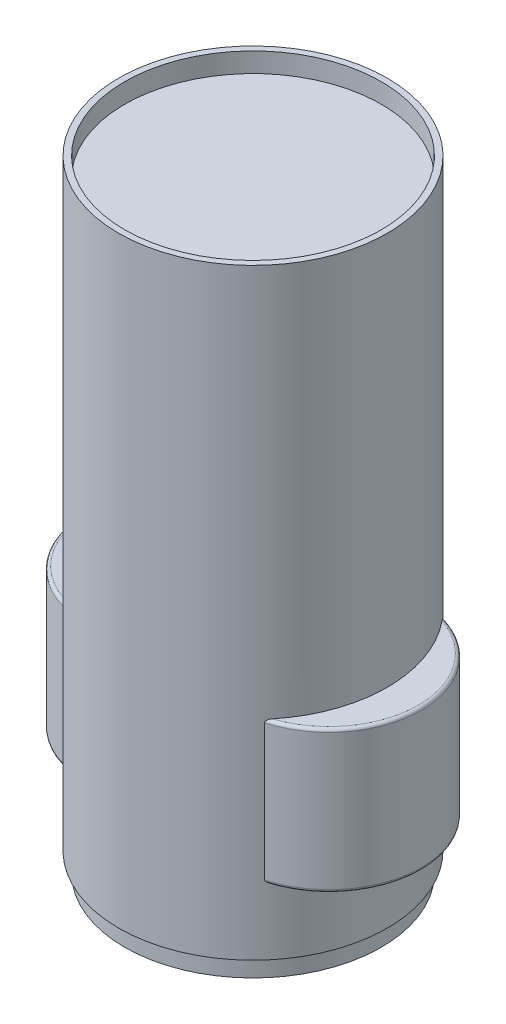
from build123d import *

# Parameters (mm, degrees)
EXTRUDE1_DEPTH = 47.07
EXTRUDE2_START = 100
EXTRUDE2_DEPTH = 100
FILLET1_R      = 1


with BuildPart() as part:
    # Sketch1 → Revolve1 (revolve)
    with BuildSketch(Plane(origin=(0, 0, 0), x_dir=(0, 0, -1), z_dir=(1, 0, 0))):
        Polygon((0, 0), (-42.5, 0), (-42.5, 6.5), (-44.5, 6.5), (-44.5, 205.8), (-42.5, 205.8), (-42.5, 199.3), (0, 199.3), align=None)
    revolve(axis=Axis((0, 199.3, 0), (0, -1, 0)))

    # Sketch2 → Extrude1 (add)
    with BuildSketch(Plane.XZ.offset(-28.5)):
        with BuildLine():
            ThreePointArc((0, -17.430935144), (55.75, 0), (0, 17.430935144))
            ThreePointArc((0, 17.430935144), (-55.75, 0), (0, -17.430935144))
        make_face()
    extrude(amount=-EXTRUDE1_DEPTH)

    # Sketch3 → Extrude2 (add)
    with BuildSketch(Plane(origin=(0, 75.57, 0), x_dir=(-1, 0, 0), z_dir=(0, 1, 0)).offset(EXTRUDE2_START)):
        with BuildLine():
            Line((48.03, 5), (48.03, -5))
            ThreePointArc((48.03, -5), (46.51379262, -6.562299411), (44.906801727, -5.093543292))
            ThreePointArc((44.906801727, -5.093543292), (44.566947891, -4.764619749), (44.209712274, -5.074577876))
            ThreePointArc((44.209712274, -5.074577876), (44.5, 0), (44.209712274, 5.074577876))
            ThreePointArc((44.209712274, 5.074577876), (44.566947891, 4.764619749), (44.906801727, 5.093543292))
            ThreePointArc((44.906801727, 5.093543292), (46.51379262, 6.562299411), (48.03, 5))
        make_face()
    extrude(amount=-EXTRUDE2_DEPTH)

    # Fillet1
    fillet1_edges = [part.edges().sort_by_distance(p)[0] for p in [
        (-55.75, 28.5, 0),
        (-55.75, 75.57, 0),
        (55.75, 75.57, 0),
        (55.75, 28.5, 0),
    ]]
    fillet(fillet1_edges, radius=FILLET1_R)


solid = part.part
